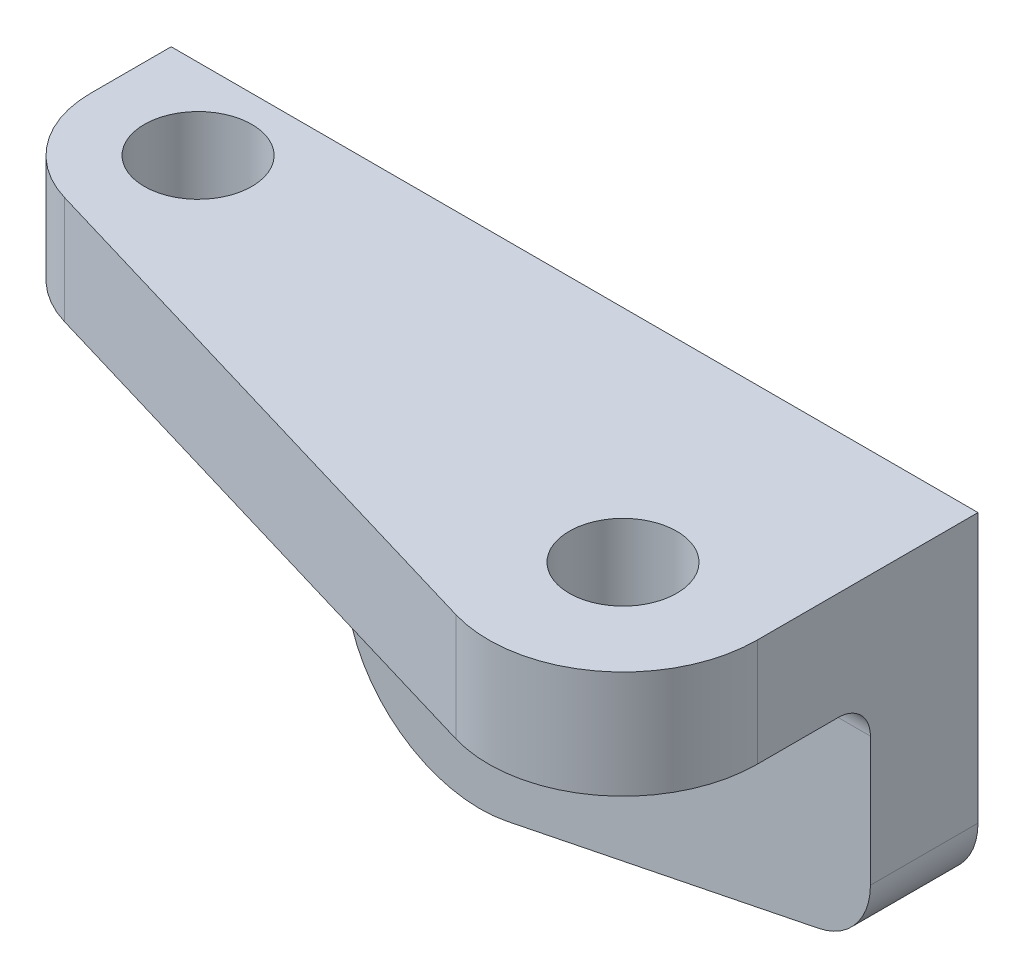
ISO-10303-21;
HEADER;
FILE_DESCRIPTION(('STEP AP214'),'2;1');
FILE_NAME('part.step','',(''),(''),'','','');
FILE_SCHEMA(('AUTOMOTIVE_DESIGN { 1 0 10303 214 1 1 1 1 }'));
ENDSEC;
DATA;
#1=APPLICATION_CONTEXT('core data for automotive mechanical design processes');
#2=APPLICATION_PROTOCOL_DEFINITION('international standard','automotive_design',2000,#1);
#3=PRODUCT_CONTEXT('',#1,'mechanical');
#4=PRODUCT('Part','Part','',(#3));
#5=PRODUCT_RELATED_PRODUCT_CATEGORY('part','',(#4));
#6=PRODUCT_DEFINITION_FORMATION('','',#4);
#7=PRODUCT_DEFINITION_CONTEXT('part definition',#1,'design');
#8=PRODUCT_DEFINITION('design','',#6,#7);
#9=PRODUCT_DEFINITION_SHAPE('','',#8);
#10=(LENGTH_UNIT() NAMED_UNIT(*) SI_UNIT(.MILLI.,.METRE.));
#11=(NAMED_UNIT(*) PLANE_ANGLE_UNIT() SI_UNIT($,.RADIAN.));
#12=(NAMED_UNIT(*) SI_UNIT($,.STERADIAN.) SOLID_ANGLE_UNIT());
#13=UNCERTAINTY_MEASURE_WITH_UNIT(LENGTH_MEASURE(1.E-05),#10,'distance_accuracy_value','');
#14=(GEOMETRIC_REPRESENTATION_CONTEXT(3) GLOBAL_UNCERTAINTY_ASSIGNED_CONTEXT((#13)) GLOBAL_UNIT_ASSIGNED_CONTEXT((#10,
#11,#12)) REPRESENTATION_CONTEXT('',''));
#15=CARTESIAN_POINT('',(0.,0.,0.));
#16=DIRECTION('',(0.,0.,1.));
#17=DIRECTION('',(1.,0.,0.));
#18=AXIS2_PLACEMENT_3D('',#15,#16,#17);
#19=CARTESIAN_POINT('',(-55.,0.,15.));
#20=DIRECTION('',(0.,1.,0.));
#21=DIRECTION('',(0.,0.,1.));
#22=AXIS2_PLACEMENT_3D('',#19,#20,#21);
#23=PLANE('',#22);
#24=CARTESIAN_POINT('',(50.,0.,41.));
#25=DIRECTION('',(0.,1.,0.));
#26=DIRECTION('',(0.,0.,1.));
#27=AXIS2_PLACEMENT_3D('',#24,#25,#26);
#28=CIRCLE('',#27,10.);
#29=CARTESIAN_POINT('',(50.,0.,51.));
#30=VERTEX_POINT('',#29);
#31=EDGE_CURVE('E172',#30,#30,#28,.T.);
#32=ORIENTED_EDGE('',*,*,#31,.T.);
#33=EDGE_LOOP('',(#32));
#34=FACE_BOUND('',#33,.T.);
#35=CARTESIAN_POINT('',(-55.,0.,15.));
#36=DIRECTION('',(0.,1.,0.));
#37=DIRECTION('',(0.,0.,1.));
#38=AXIS2_PLACEMENT_3D('',#35,#36,#37);
#39=CIRCLE('',#38,10.);
#40=CARTESIAN_POINT('',(-55.,0.,25.));
#41=VERTEX_POINT('',#40);
#42=EDGE_CURVE('E179',#41,#41,#39,.T.);
#43=ORIENTED_EDGE('',*,*,#42,.T.);
#44=EDGE_LOOP('',(#43));
#45=FACE_BOUND('',#44,.T.);
#46=DIRECTION('',(0.,0.,-1.));
#47=VECTOR('',#46,1.);
#48=CARTESIAN_POINT('',(-28.5793993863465,0.,15.));
#49=LINE('',#48,#47);
#50=CARTESIAN_POINT('',(-28.5793993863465,0.,0.));
#51=VERTEX_POINT('',#50);
#52=CARTESIAN_POINT('',(-28.5793993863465,0.,26.));
#53=VERTEX_POINT('',#52);
#54=EDGE_CURVE('E58',#51,#53,#49,.F.);
#55=ORIENTED_EDGE('',*,*,#54,.T.);
#56=DIRECTION('',(1.,0.,0.));
#57=VECTOR('',#56,1.);
#58=CARTESIAN_POINT('',(75.,0.,26.));
#59=LINE('',#58,#57);
#60=CARTESIAN_POINT('',(75.,0.,26.));
#61=VERTEX_POINT('',#60);
#62=EDGE_CURVE('E235',#53,#61,#59,.T.);
#63=ORIENTED_EDGE('',*,*,#62,.T.);
#64=DIRECTION('',(0.,0.,-1.));
#65=VECTOR('',#64,1.);
#66=CARTESIAN_POINT('',(75.,0.,41.));
#67=LINE('',#66,#65);
#68=CARTESIAN_POINT('',(75.,0.,41.));
#69=VERTEX_POINT('',#68);
#70=EDGE_CURVE('E185',#69,#61,#67,.T.);
#71=ORIENTED_EDGE('',*,*,#70,.F.);
#72=CARTESIAN_POINT('',(50.,0.,41.));
#73=DIRECTION('',(0.,1.,0.));
#74=DIRECTION('',(0.,0.,1.));
#75=AXIS2_PLACEMENT_3D('',#72,#73,#74);
#76=CIRCLE('',#75,25.);
#77=CARTESIAN_POINT('',(42.8757284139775,0.,64.9634044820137));
#78=VERTEX_POINT('',#77);
#79=EDGE_CURVE('E192',#78,#69,#76,.T.);
#80=ORIENTED_EDGE('',*,*,#79,.F.);
#81=DIRECTION('',(0.958536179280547,0.,0.284970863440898));
#82=VECTOR('',#81,1.);
#83=CARTESIAN_POINT('',(-60.6994172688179,0.,34.1707235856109));
#84=LINE('',#83,#82);
#85=CARTESIAN_POINT('',(-60.6994172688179,0.,34.1707235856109));
#86=VERTEX_POINT('',#85);
#87=EDGE_CURVE('E210',#86,#78,#84,.T.);
#88=ORIENTED_EDGE('',*,*,#87,.F.);
#89=CARTESIAN_POINT('',(-55.,0.,15.));
#90=DIRECTION('',(0.,1.,0.));
#91=DIRECTION('',(0.,0.,1.));
#92=AXIS2_PLACEMENT_3D('',#89,#90,#91);
#93=CIRCLE('',#92,20.);
#94=CARTESIAN_POINT('',(-75.,0.,15.));
#95=VERTEX_POINT('',#94);
#96=EDGE_CURVE('E208',#95,#86,#93,.T.);
#97=ORIENTED_EDGE('',*,*,#96,.F.);
#98=DIRECTION('',(0.,0.,1.));
#99=VECTOR('',#98,1.);
#100=CARTESIAN_POINT('',(-75.,0.,15.));
#101=LINE('',#100,#99);
#102=CARTESIAN_POINT('',(-75.,0.,0.));
#103=VERTEX_POINT('',#102);
#104=EDGE_CURVE('E206',#103,#95,#101,.T.);
#105=ORIENTED_EDGE('',*,*,#104,.F.);
#106=DIRECTION('',(-1.,0.,0.));
#107=VECTOR('',#106,1.);
#108=CARTESIAN_POINT('',(-75.,0.,0.));
#109=LINE('',#108,#107);
#110=EDGE_CURVE('E204',#51,#103,#109,.T.);
#111=ORIENTED_EDGE('',*,*,#110,.F.);
#112=EDGE_LOOP('',(#55,#63,#71,#80,#88,#97,#105,#111));
#113=FACE_BOUND('',#112,.T.);
#114=ADVANCED_FACE('F36',(#34,#45,#113),#23,.F.);
#115=CARTESIAN_POINT('',(-55.,20.,15.));
#116=DIRECTION('',(0.,1.,0.));
#117=DIRECTION('',(0.,0.,1.));
#118=AXIS2_PLACEMENT_3D('',#115,#116,#117);
#119=PLANE('',#118);
#120=CARTESIAN_POINT('',(-55.,20.,15.));
#121=DIRECTION('',(0.,1.,0.));
#122=DIRECTION('',(0.,0.,1.));
#123=AXIS2_PLACEMENT_3D('',#120,#121,#122);
#124=CIRCLE('',#123,10.);
#125=CARTESIAN_POINT('',(-55.,20.,25.));
#126=VERTEX_POINT('',#125);
#127=EDGE_CURVE('E182',#126,#126,#124,.T.);
#128=ORIENTED_EDGE('',*,*,#127,.F.);
#129=EDGE_LOOP('',(#128));
#130=FACE_BOUND('',#129,.T.);
#131=DIRECTION('',(0.,0.,-1.));
#132=VECTOR('',#131,1.);
#133=CARTESIAN_POINT('',(75.,20.,41.));
#134=LINE('',#133,#132);
#135=CARTESIAN_POINT('',(75.,20.,41.));
#136=VERTEX_POINT('',#135);
#137=CARTESIAN_POINT('',(75.,20.,0.));
#138=VERTEX_POINT('',#137);
#139=EDGE_CURVE('E188',#136,#138,#134,.T.);
#140=ORIENTED_EDGE('',*,*,#139,.T.);
#141=DIRECTION('',(-1.,0.,0.));
#142=VECTOR('',#141,1.);
#143=CARTESIAN_POINT('',(-75.,20.,0.));
#144=LINE('',#143,#142);
#145=CARTESIAN_POINT('',(-75.,20.,0.));
#146=VERTEX_POINT('',#145);
#147=EDGE_CURVE('E191',#138,#146,#144,.T.);
#148=ORIENTED_EDGE('',*,*,#147,.T.);
#149=DIRECTION('',(0.,0.,1.));
#150=VECTOR('',#149,1.);
#151=CARTESIAN_POINT('',(-75.,20.,15.));
#152=LINE('',#151,#150);
#153=CARTESIAN_POINT('',(-75.,20.,15.));
#154=VERTEX_POINT('',#153);
#155=EDGE_CURVE('E194',#146,#154,#152,.T.);
#156=ORIENTED_EDGE('',*,*,#155,.T.);
#157=CARTESIAN_POINT('',(-55.,20.,15.));
#158=DIRECTION('',(0.,1.,0.));
#159=DIRECTION('',(0.,0.,1.));
#160=AXIS2_PLACEMENT_3D('',#157,#158,#159);
#161=CIRCLE('',#160,20.);
#162=CARTESIAN_POINT('',(-60.6994172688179,20.,34.1707235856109));
#163=VERTEX_POINT('',#162);
#164=EDGE_CURVE('E196',#154,#163,#161,.T.);
#165=ORIENTED_EDGE('',*,*,#164,.T.);
#166=DIRECTION('',(0.958536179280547,0.,0.284970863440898));
#167=VECTOR('',#166,1.);
#168=CARTESIAN_POINT('',(-60.6994172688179,20.,34.1707235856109));
#169=LINE('',#168,#167);
#170=CARTESIAN_POINT('',(42.8757284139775,20.,64.9634044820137));
#171=VERTEX_POINT('',#170);
#172=EDGE_CURVE('E198',#163,#171,#169,.T.);
#173=ORIENTED_EDGE('',*,*,#172,.T.);
#174=CARTESIAN_POINT('',(50.,20.,41.));
#175=DIRECTION('',(0.,1.,0.));
#176=DIRECTION('',(0.,0.,1.));
#177=AXIS2_PLACEMENT_3D('',#174,#175,#176);
#178=CIRCLE('',#177,25.);
#179=EDGE_CURVE('E200',#171,#136,#178,.T.);
#180=ORIENTED_EDGE('',*,*,#179,.T.);
#181=EDGE_LOOP('',(#140,#148,#156,#165,#173,#180));
#182=FACE_BOUND('',#181,.T.);
#183=CARTESIAN_POINT('',(50.,20.,41.));
#184=DIRECTION('',(0.,1.,0.));
#185=DIRECTION('',(0.,0.,1.));
#186=AXIS2_PLACEMENT_3D('',#183,#184,#185);
#187=CIRCLE('',#186,10.);
#188=CARTESIAN_POINT('',(50.,20.,51.));
#189=VERTEX_POINT('',#188);
#190=EDGE_CURVE('E176',#189,#189,#187,.T.);
#191=ORIENTED_EDGE('',*,*,#190,.F.);
#192=EDGE_LOOP('',(#191));
#193=FACE_BOUND('',#192,.T.);
#194=ADVANCED_FACE('F281',(#130,#182,#193),#119,.T.);
#195=CARTESIAN_POINT('',(75.,20.,41.));
#196=DIRECTION('',(-1.,0.,0.));
#197=DIRECTION('',(0.,0.,1.));
#198=AXIS2_PLACEMENT_3D('',#195,#196,#197);
#199=PLANE('',#198);
#200=ORIENTED_EDGE('',*,*,#70,.T.);
#201=CARTESIAN_POINT('',(75.,-6.,26.));
#202=DIRECTION('',(-1.,0.,0.));
#203=DIRECTION('',(0.,0.,1.));
#204=AXIS2_PLACEMENT_3D('',#201,#202,#203);
#205=CIRCLE('',#204,6.);
#206=CARTESIAN_POINT('',(75.,-6.,20.));
#207=VERTEX_POINT('',#206);
#208=EDGE_CURVE('E44',#61,#207,#205,.T.);
#209=ORIENTED_EDGE('',*,*,#208,.T.);
#210=DIRECTION('',(0.,-1.,0.));
#211=VECTOR('',#210,1.);
#212=CARTESIAN_POINT('',(75.,0.,20.));
#213=LINE('',#212,#211);
#214=CARTESIAN_POINT('',(75.,-30.,20.));
#215=VERTEX_POINT('',#214);
#216=EDGE_CURVE('E126',#207,#215,#213,.T.);
#217=ORIENTED_EDGE('',*,*,#216,.T.);
#218=DIRECTION('',(0.,0.,-1.));
#219=VECTOR('',#218,1.);
#220=CARTESIAN_POINT('',(75.,-30.,20.));
#221=LINE('',#220,#219);
#222=CARTESIAN_POINT('',(75.,-30.,0.));
#223=VERTEX_POINT('',#222);
#224=EDGE_CURVE('E130',#215,#223,#221,.T.);
#225=ORIENTED_EDGE('',*,*,#224,.T.);
#226=DIRECTION('',(0.,-1.,0.));
#227=VECTOR('',#226,1.);
#228=CARTESIAN_POINT('',(75.,20.,0.));
#229=LINE('',#228,#227);
#230=EDGE_CURVE('E227',#138,#223,#229,.T.);
#231=ORIENTED_EDGE('',*,*,#230,.F.);
#232=ORIENTED_EDGE('',*,*,#139,.F.);
#233=DIRECTION('',(0.,-1.,0.));
#234=VECTOR('',#233,1.);
#235=CARTESIAN_POINT('',(75.,20.,41.));
#236=LINE('',#235,#234);
#237=EDGE_CURVE('E202',#136,#69,#236,.T.);
#238=ORIENTED_EDGE('',*,*,#237,.T.);
#239=EDGE_LOOP('',(#200,#209,#217,#225,#231,#232,#238));
#240=FACE_BOUND('',#239,.T.);
#241=ADVANCED_FACE('F128',(#240),#199,.F.);
#242=CARTESIAN_POINT('',(-75.,20.,0.));
#243=DIRECTION('',(0.,0.,1.));
#244=DIRECTION('',(1.,0.,0.));
#245=AXIS2_PLACEMENT_3D('',#242,#243,#244);
#246=PLANE('',#245);
#247=ORIENTED_EDGE('',*,*,#230,.T.);
#248=CARTESIAN_POINT('',(63.,-30.,0.));
#249=DIRECTION('',(0.,0.,-1.));
#250=DIRECTION('',(-1.,0.,0.));
#251=AXIS2_PLACEMENT_3D('',#248,#249,#250);
#252=CIRCLE('',#251,12.);
#253=CARTESIAN_POINT('',(65.3809840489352,-41.7614163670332,0.));
#254=VERTEX_POINT('',#253);
#255=EDGE_CURVE('E142',#223,#254,#252,.T.);
#256=ORIENTED_EDGE('',*,*,#255,.T.);
#257=DIRECTION('',(-0.980118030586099,-0.198415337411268,0.));
#258=VECTOR('',#257,1.);
#259=CARTESIAN_POINT('',(65.3809840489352,-41.7614163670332,0.));
#260=LINE('',#259,#258);
#261=CARTESIAN_POINT('',(7.38098404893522,-53.5029507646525,0.));
#262=VERTEX_POINT('',#261);
#263=EDGE_CURVE('E161',#254,#262,#260,.T.);
#264=ORIENTED_EDGE('',*,*,#263,.T.);
#265=CARTESIAN_POINT('',(2.4206006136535,-29.,0.));
#266=DIRECTION('',(0.,0.,-1.));
#267=DIRECTION('',(-1.,0.,0.));
#268=AXIS2_PLACEMENT_3D('',#265,#266,#267);
#269=CIRCLE('',#268,25.);
#270=CARTESIAN_POINT('',(-22.5793993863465,-29.,0.));
#271=VERTEX_POINT('',#270);
#272=EDGE_CURVE('E165',#262,#271,#269,.T.);
#273=ORIENTED_EDGE('',*,*,#272,.T.);
#274=DIRECTION('',(0.,1.,0.));
#275=VECTOR('',#274,1.);
#276=CARTESIAN_POINT('',(-22.5793993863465,0.,0.));
#277=LINE('',#276,#275);
#278=CARTESIAN_POINT('',(-22.5793993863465,-6.,0.));
#279=VERTEX_POINT('',#278);
#280=EDGE_CURVE('E136',#271,#279,#277,.T.);
#281=ORIENTED_EDGE('',*,*,#280,.T.);
#282=CARTESIAN_POINT('',(-28.5793993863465,-6.,0.));
#283=DIRECTION('',(0.,0.,1.));
#284=DIRECTION('',(1.,0.,0.));
#285=AXIS2_PLACEMENT_3D('',#282,#283,#284);
#286=CIRCLE('',#285,6.);
#287=EDGE_CURVE('E233',#279,#51,#286,.T.);
#288=ORIENTED_EDGE('',*,*,#287,.T.);
#289=ORIENTED_EDGE('',*,*,#110,.T.);
#290=DIRECTION('',(0.,-1.,0.));
#291=VECTOR('',#290,1.);
#292=CARTESIAN_POINT('',(-75.,20.,0.));
#293=LINE('',#292,#291);
#294=EDGE_CURVE('E224',#146,#103,#293,.T.);
#295=ORIENTED_EDGE('',*,*,#294,.F.);
#296=ORIENTED_EDGE('',*,*,#147,.F.);
#297=EDGE_LOOP('',(#247,#256,#264,#273,#281,#288,#289,#295,#296));
#298=FACE_BOUND('',#297,.T.);
#299=CARTESIAN_POINT('',(2.4206006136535,-29.,0.));
#300=DIRECTION('',(0.,0.,-1.));
#301=DIRECTION('',(-1.,0.,0.));
#302=AXIS2_PLACEMENT_3D('',#299,#300,#301);
#303=CIRCLE('',#302,9.);
#304=CARTESIAN_POINT('',(-6.5793993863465,-29.,0.));
#305=VERTEX_POINT('',#304);
#306=EDGE_CURVE('E451',#305,#305,#303,.T.);
#307=ORIENTED_EDGE('',*,*,#306,.F.);
#308=EDGE_LOOP('',(#307));
#309=FACE_BOUND('',#308,.T.);
#310=ADVANCED_FACE('F272',(#298,#309),#246,.F.);
#311=CARTESIAN_POINT('',(-75.,20.,15.));
#312=DIRECTION('',(1.,0.,0.));
#313=DIRECTION('',(0.,0.,-1.));
#314=AXIS2_PLACEMENT_3D('',#311,#312,#313);
#315=PLANE('',#314);
#316=ORIENTED_EDGE('',*,*,#104,.T.);
#317=DIRECTION('',(0.,-1.,0.));
#318=VECTOR('',#317,1.);
#319=CARTESIAN_POINT('',(-75.,20.,15.));
#320=LINE('',#319,#318);
#321=EDGE_CURVE('E221',#154,#95,#320,.T.);
#322=ORIENTED_EDGE('',*,*,#321,.F.);
#323=ORIENTED_EDGE('',*,*,#155,.F.);
#324=ORIENTED_EDGE('',*,*,#294,.T.);
#325=EDGE_LOOP('',(#316,#322,#323,#324));
#326=FACE_BOUND('',#325,.T.);
#327=ADVANCED_FACE('F269',(#326),#315,.F.);
#328=CARTESIAN_POINT('',(-55.,20.,15.));
#329=DIRECTION('',(0.,-1.,0.));
#330=DIRECTION('',(0.,0.,-1.));
#331=AXIS2_PLACEMENT_3D('',#328,#329,#330);
#332=CYLINDRICAL_SURFACE('',#331,20.);
#333=ORIENTED_EDGE('',*,*,#96,.T.);
#334=DIRECTION('',(0.,-1.,0.));
#335=VECTOR('',#334,1.);
#336=CARTESIAN_POINT('',(-60.6994172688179,20.,34.1707235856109));
#337=LINE('',#336,#335);
#338=EDGE_CURVE('E218',#163,#86,#337,.T.);
#339=ORIENTED_EDGE('',*,*,#338,.F.);
#340=ORIENTED_EDGE('',*,*,#164,.F.);
#341=ORIENTED_EDGE('',*,*,#321,.T.);
#342=EDGE_LOOP('',(#333,#339,#340,#341));
#343=FACE_BOUND('',#342,.T.);
#344=ADVANCED_FACE('F265',(#343),#332,.T.);
#345=CARTESIAN_POINT('',(-60.6994172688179,20.,34.1707235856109));
#346=DIRECTION('',(0.284970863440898,0.,-0.958536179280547));
#347=DIRECTION('',(-0.958536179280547,0.,-0.284970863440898));
#348=AXIS2_PLACEMENT_3D('',#345,#346,#347);
#349=PLANE('',#348);
#350=ORIENTED_EDGE('',*,*,#87,.T.);
#351=DIRECTION('',(0.,-1.,0.));
#352=VECTOR('',#351,1.);
#353=CARTESIAN_POINT('',(42.8757284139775,20.,64.9634044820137));
#354=LINE('',#353,#352);
#355=EDGE_CURVE('E215',#171,#78,#354,.T.);
#356=ORIENTED_EDGE('',*,*,#355,.F.);
#357=ORIENTED_EDGE('',*,*,#172,.F.);
#358=ORIENTED_EDGE('',*,*,#338,.T.);
#359=EDGE_LOOP('',(#350,#356,#357,#358));
#360=FACE_BOUND('',#359,.T.);
#361=ADVANCED_FACE('F260',(#360),#349,.F.);
#362=CARTESIAN_POINT('',(50.,20.,41.));
#363=DIRECTION('',(0.,-1.,0.));
#364=DIRECTION('',(0.,0.,-1.));
#365=AXIS2_PLACEMENT_3D('',#362,#363,#364);
#366=CYLINDRICAL_SURFACE('',#365,25.);
#367=ORIENTED_EDGE('',*,*,#79,.T.);
#368=ORIENTED_EDGE('',*,*,#237,.F.);
#369=ORIENTED_EDGE('',*,*,#179,.F.);
#370=ORIENTED_EDGE('',*,*,#355,.T.);
#371=EDGE_LOOP('',(#367,#368,#369,#370));
#372=FACE_BOUND('',#371,.T.);
#373=ADVANCED_FACE('F254',(#372),#366,.T.);
#374=CARTESIAN_POINT('',(-55.,20.,15.));
#375=DIRECTION('',(0.,-1.,0.));
#376=DIRECTION('',(0.,0.,-1.));
#377=AXIS2_PLACEMENT_3D('',#374,#375,#376);
#378=CYLINDRICAL_SURFACE('',#377,10.);
#379=ORIENTED_EDGE('',*,*,#127,.T.);
#380=EDGE_LOOP('',(#379));
#381=FACE_BOUND('',#380,.T.);
#382=ORIENTED_EDGE('',*,*,#42,.F.);
#383=EDGE_LOOP('',(#382));
#384=FACE_BOUND('',#383,.T.);
#385=ADVANCED_FACE('F291',(#381,#384),#378,.F.);
#386=CARTESIAN_POINT('',(50.,20.,41.));
#387=DIRECTION('',(0.,-1.,0.));
#388=DIRECTION('',(0.,0.,-1.));
#389=AXIS2_PLACEMENT_3D('',#386,#387,#388);
#390=CYLINDRICAL_SURFACE('',#389,10.);
#391=ORIENTED_EDGE('',*,*,#190,.T.);
#392=EDGE_LOOP('',(#391));
#393=FACE_BOUND('',#392,.T.);
#394=ORIENTED_EDGE('',*,*,#31,.F.);
#395=EDGE_LOOP('',(#394));
#396=FACE_BOUND('',#395,.T.);
#397=ADVANCED_FACE('F288',(#393,#396),#390,.F.);
#398=CARTESIAN_POINT('',(-22.5793993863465,0.,20.));
#399=DIRECTION('',(-1.,0.,0.));
#400=DIRECTION('',(0.,0.,1.));
#401=AXIS2_PLACEMENT_3D('',#398,#399,#400);
#402=PLANE('',#401);
#403=DIRECTION('',(0.,1.,0.));
#404=VECTOR('',#403,1.);
#405=CARTESIAN_POINT('',(-22.5793993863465,0.,20.));
#406=LINE('',#405,#404);
#407=CARTESIAN_POINT('',(-22.5793993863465,-29.,20.));
#408=VERTEX_POINT('',#407);
#409=CARTESIAN_POINT('',(-22.5793993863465,-6.,20.));
#410=VERTEX_POINT('',#409);
#411=EDGE_CURVE('E144',#408,#410,#406,.T.);
#412=ORIENTED_EDGE('',*,*,#411,.T.);
#413=DIRECTION('',(0.,0.,-1.));
#414=VECTOR('',#413,1.);
#415=CARTESIAN_POINT('',(-22.5793993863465,-6.,20.));
#416=LINE('',#415,#414);
#417=EDGE_CURVE('E229',#410,#279,#416,.T.);
#418=ORIENTED_EDGE('',*,*,#417,.T.);
#419=ORIENTED_EDGE('',*,*,#280,.F.);
#420=DIRECTION('',(0.,0.,-1.));
#421=VECTOR('',#420,1.);
#422=CARTESIAN_POINT('',(-22.5793993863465,-29.,20.));
#423=LINE('',#422,#421);
#424=EDGE_CURVE('E170',#408,#271,#423,.T.);
#425=ORIENTED_EDGE('',*,*,#424,.F.);
#426=EDGE_LOOP('',(#412,#418,#419,#425));
#427=FACE_BOUND('',#426,.T.);
#428=ADVANCED_FACE('F243',(#427),#402,.T.);
#429=CARTESIAN_POINT('',(2.4206006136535,-29.,20.));
#430=DIRECTION('',(0.,0.,-1.));
#431=DIRECTION('',(-1.,0.,0.));
#432=AXIS2_PLACEMENT_3D('',#429,#430,#431);
#433=CYLINDRICAL_SURFACE('',#432,25.);
#434=ORIENTED_EDGE('',*,*,#272,.F.);
#435=DIRECTION('',(0.,0.,-1.));
#436=VECTOR('',#435,1.);
#437=CARTESIAN_POINT('',(7.38098404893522,-53.5029507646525,20.));
#438=LINE('',#437,#436);
#439=CARTESIAN_POINT('',(7.38098404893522,-53.5029507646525,20.));
#440=VERTEX_POINT('',#439);
#441=EDGE_CURVE('E173',#440,#262,#438,.T.);
#442=ORIENTED_EDGE('',*,*,#441,.F.);
#443=CARTESIAN_POINT('',(2.4206006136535,-29.,20.));
#444=DIRECTION('',(0.,0.,-1.));
#445=DIRECTION('',(-1.,0.,0.));
#446=AXIS2_PLACEMENT_3D('',#443,#444,#445);
#447=CIRCLE('',#446,25.);
#448=EDGE_CURVE('E152',#440,#408,#447,.T.);
#449=ORIENTED_EDGE('',*,*,#448,.T.);
#450=ORIENTED_EDGE('',*,*,#424,.T.);
#451=EDGE_LOOP('',(#434,#442,#449,#450));
#452=FACE_BOUND('',#451,.T.);
#453=ADVANCED_FACE('F277',(#452),#433,.T.);
#454=CARTESIAN_POINT('',(65.3809840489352,-41.7614163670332,20.));
#455=DIRECTION('',(0.198415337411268,-0.980118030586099,0.));
#456=DIRECTION('',(0.980118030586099,0.198415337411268,0.));
#457=AXIS2_PLACEMENT_3D('',#454,#455,#456);
#458=PLANE('',#457);
#459=ORIENTED_EDGE('',*,*,#263,.F.);
#460=DIRECTION('',(0.,0.,-1.));
#461=VECTOR('',#460,1.);
#462=CARTESIAN_POINT('',(65.3809840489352,-41.7614163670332,20.));
#463=LINE('',#462,#461);
#464=CARTESIAN_POINT('',(65.3809840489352,-41.7614163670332,20.));
#465=VERTEX_POINT('',#464);
#466=EDGE_CURVE('E143',#465,#254,#463,.T.);
#467=ORIENTED_EDGE('',*,*,#466,.F.);
#468=DIRECTION('',(-0.980118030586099,-0.198415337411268,0.));
#469=VECTOR('',#468,1.);
#470=CARTESIAN_POINT('',(65.3809840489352,-41.7614163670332,20.));
#471=LINE('',#470,#469);
#472=EDGE_CURVE('E150',#465,#440,#471,.T.);
#473=ORIENTED_EDGE('',*,*,#472,.T.);
#474=ORIENTED_EDGE('',*,*,#441,.T.);
#475=EDGE_LOOP('',(#459,#467,#473,#474));
#476=FACE_BOUND('',#475,.T.);
#477=ADVANCED_FACE('F279',(#476),#458,.T.);
#478=CARTESIAN_POINT('',(63.,-30.,20.));
#479=DIRECTION('',(0.,0.,-1.));
#480=DIRECTION('',(-1.,0.,0.));
#481=AXIS2_PLACEMENT_3D('',#478,#479,#480);
#482=CYLINDRICAL_SURFACE('',#481,12.);
#483=ORIENTED_EDGE('',*,*,#255,.F.);
#484=ORIENTED_EDGE('',*,*,#224,.F.);
#485=CARTESIAN_POINT('',(63.,-30.,20.));
#486=DIRECTION('',(0.,0.,-1.));
#487=DIRECTION('',(-1.,0.,0.));
#488=AXIS2_PLACEMENT_3D('',#485,#486,#487);
#489=CIRCLE('',#488,12.);
#490=EDGE_CURVE('E135',#215,#465,#489,.T.);
#491=ORIENTED_EDGE('',*,*,#490,.T.);
#492=ORIENTED_EDGE('',*,*,#466,.T.);
#493=EDGE_LOOP('',(#483,#484,#491,#492));
#494=FACE_BOUND('',#493,.T.);
#495=ADVANCED_FACE('F140',(#494),#482,.T.);
#496=CARTESIAN_POINT('',(63.,-30.,20.));
#497=DIRECTION('',(0.,0.,-1.));
#498=DIRECTION('',(-1.,0.,0.));
#499=AXIS2_PLACEMENT_3D('',#496,#497,#498);
#500=PLANE('',#499);
#501=CARTESIAN_POINT('',(2.4206006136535,-29.,20.));
#502=DIRECTION('',(0.,0.,-1.));
#503=DIRECTION('',(-1.,0.,0.));
#504=AXIS2_PLACEMENT_3D('',#501,#502,#503);
#505=CIRCLE('',#504,9.);
#506=CARTESIAN_POINT('',(-6.5793993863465,-29.,20.));
#507=VERTEX_POINT('',#506);
#508=EDGE_CURVE('E162',#507,#507,#505,.T.);
#509=ORIENTED_EDGE('',*,*,#508,.T.);
#510=EDGE_LOOP('',(#509));
#511=FACE_BOUND('',#510,.T.);
#512=ORIENTED_EDGE('',*,*,#216,.F.);
#513=DIRECTION('',(1.,0.,0.));
#514=VECTOR('',#513,1.);
#515=CARTESIAN_POINT('',(-28.5793993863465,-6.,20.));
#516=LINE('',#515,#514);
#517=EDGE_CURVE('E237',#207,#410,#516,.F.);
#518=ORIENTED_EDGE('',*,*,#517,.T.);
#519=ORIENTED_EDGE('',*,*,#411,.F.);
#520=ORIENTED_EDGE('',*,*,#448,.F.);
#521=ORIENTED_EDGE('',*,*,#472,.F.);
#522=ORIENTED_EDGE('',*,*,#490,.F.);
#523=EDGE_LOOP('',(#512,#518,#519,#520,#521,#522));
#524=FACE_BOUND('',#523,.T.);
#525=ADVANCED_FACE('F147',(#511,#524),#500,.F.);
#526=CARTESIAN_POINT('',(2.4206006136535,-29.,20.));
#527=DIRECTION('',(0.,0.,-1.));
#528=DIRECTION('',(-1.,0.,0.));
#529=AXIS2_PLACEMENT_3D('',#526,#527,#528);
#530=CYLINDRICAL_SURFACE('',#529,9.);
#531=ORIENTED_EDGE('',*,*,#508,.F.);
#532=EDGE_LOOP('',(#531));
#533=FACE_BOUND('',#532,.T.);
#534=ORIENTED_EDGE('',*,*,#306,.T.);
#535=EDGE_LOOP('',(#534));
#536=FACE_BOUND('',#535,.T.);
#537=ADVANCED_FACE('F319',(#533,#536),#530,.F.);
#538=CARTESIAN_POINT('',(-28.5793993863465,-6.,20.));
#539=DIRECTION('',(0.,0.,-1.));
#540=DIRECTION('',(-1.,0.,0.));
#541=AXIS2_PLACEMENT_3D('',#538,#539,#540);
#542=CYLINDRICAL_SURFACE('',#541,6.);
#543=ORIENTED_EDGE('',*,*,#417,.F.);
#544=CARTESIAN_POINT('',(-28.5793993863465,-6.,26.));
#545=DIRECTION('',(-0.707106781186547,0.,-0.707106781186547));
#546=DIRECTION('',(0.707106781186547,0.,-0.707106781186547));
#547=AXIS2_PLACEMENT_3D('',#544,#545,#546);
#548=ELLIPSE('',#547,8.48528137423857,6.);
#549=EDGE_CURVE('E11',#410,#53,#548,.F.);
#550=ORIENTED_EDGE('',*,*,#549,.T.);
#551=ORIENTED_EDGE('',*,*,#54,.F.);
#552=ORIENTED_EDGE('',*,*,#287,.F.);
#553=EDGE_LOOP('',(#543,#550,#551,#552));
#554=FACE_BOUND('',#553,.T.);
#555=ADVANCED_FACE('F246',(#554),#542,.F.);
#556=CARTESIAN_POINT('',(-55.,-6.,26.));
#557=DIRECTION('',(-1.,0.,0.));
#558=DIRECTION('',(0.,0.,1.));
#559=AXIS2_PLACEMENT_3D('',#556,#557,#558);
#560=CYLINDRICAL_SURFACE('',#559,6.);
#561=ORIENTED_EDGE('',*,*,#549,.F.);
#562=ORIENTED_EDGE('',*,*,#517,.F.);
#563=ORIENTED_EDGE('',*,*,#208,.F.);
#564=ORIENTED_EDGE('',*,*,#62,.F.);
#565=EDGE_LOOP('',(#561,#562,#563,#564));
#566=FACE_BOUND('',#565,.T.);
#567=ADVANCED_FACE('F38',(#566),#560,.F.);
#568=CLOSED_SHELL('',(#114,#194,#241,#310,#327,#344,#361,#373,#385,#397,#428,#453,#477,#495,
#525,#537,#555,#567));
#569=MANIFOLD_SOLID_BREP('B2',#568);
#570=ADVANCED_BREP_SHAPE_REPRESENTATION('',(#18,#569),#14);
#571=SHAPE_DEFINITION_REPRESENTATION(#9,#570);
ENDSEC;
END-ISO-10303-21;
